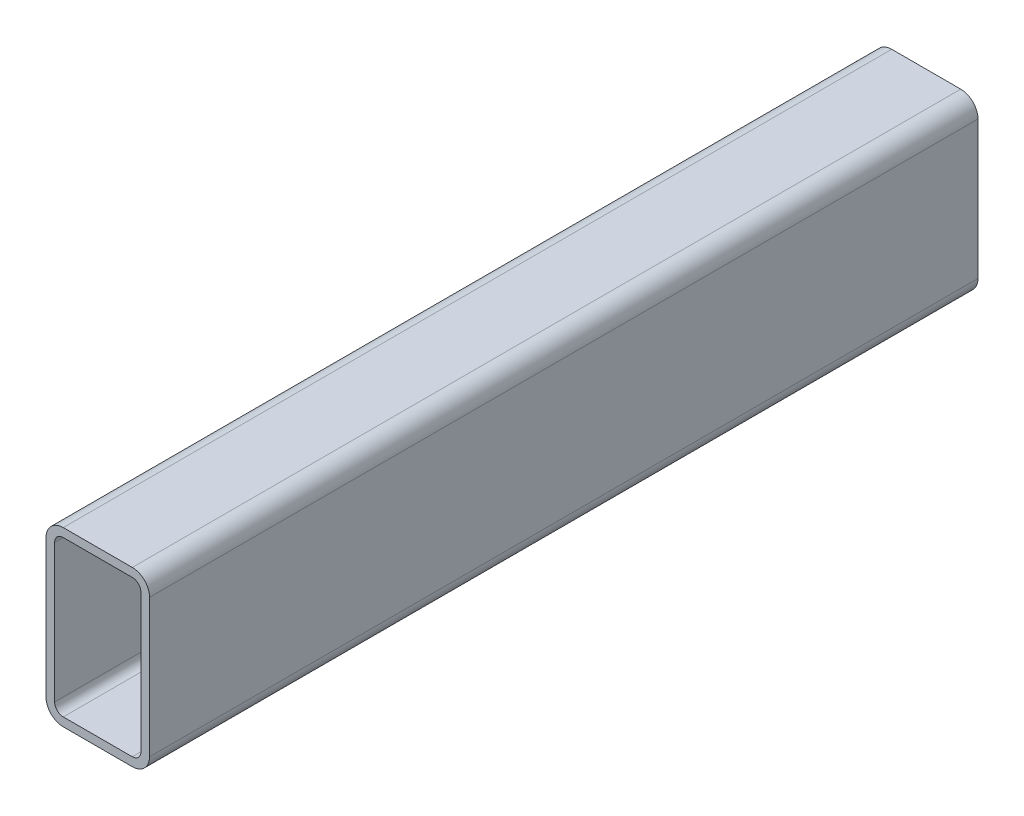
from build123d import *

# Parameters (mm, degrees)
BOSS_EXTRUDE1_DEPTH = 304.8


with BuildPart() as part:
    # Sketch1 → Boss-Extrude1 (new body)
    with BuildSketch(Plane.XY):
        with BuildLine():
            Line((6.35, 63.5), (31.75, 63.5))
            ThreePointArc((31.75, 63.5), (36.240128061, 61.640128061), (38.1, 57.15))
            Line((38.1, 57.15), (38.1, 6.35))
            ThreePointArc((38.1, 6.35), (36.240128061, 1.859871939), (31.75, 0))
            Line((31.75, 0), (6.35, 0))
            ThreePointArc((6.35, 0), (1.859871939, 1.859871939), (0, 6.35))
            Line((0, 6.35), (0, 57.15))
            ThreePointArc((0, 57.15), (1.859871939, 61.640128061), (6.35, 63.5))
        make_face()
        with BuildLine():
            Line((6.35, 60.325), (31.75, 60.325))
            ThreePointArc((31.75, 60.325), (33.99506403, 59.39506403), (34.925, 57.15))
            Line((34.925, 57.15), (34.925, 6.35))
            ThreePointArc((34.925, 6.35), (33.99506403, 4.10493597), (31.75, 3.175))
            Line((31.75, 3.175), (6.35, 3.175))
            ThreePointArc((6.35, 3.175), (4.10493597, 4.10493597), (3.175, 6.35))
            Line((3.175, 6.35), (3.175, 57.15))
            ThreePointArc((3.175, 57.15), (4.10493597, 59.39506403), (6.35, 60.325))
        make_face(mode=Mode.SUBTRACT)
    extrude(amount=BOSS_EXTRUDE1_DEPTH)


solid = part.part
